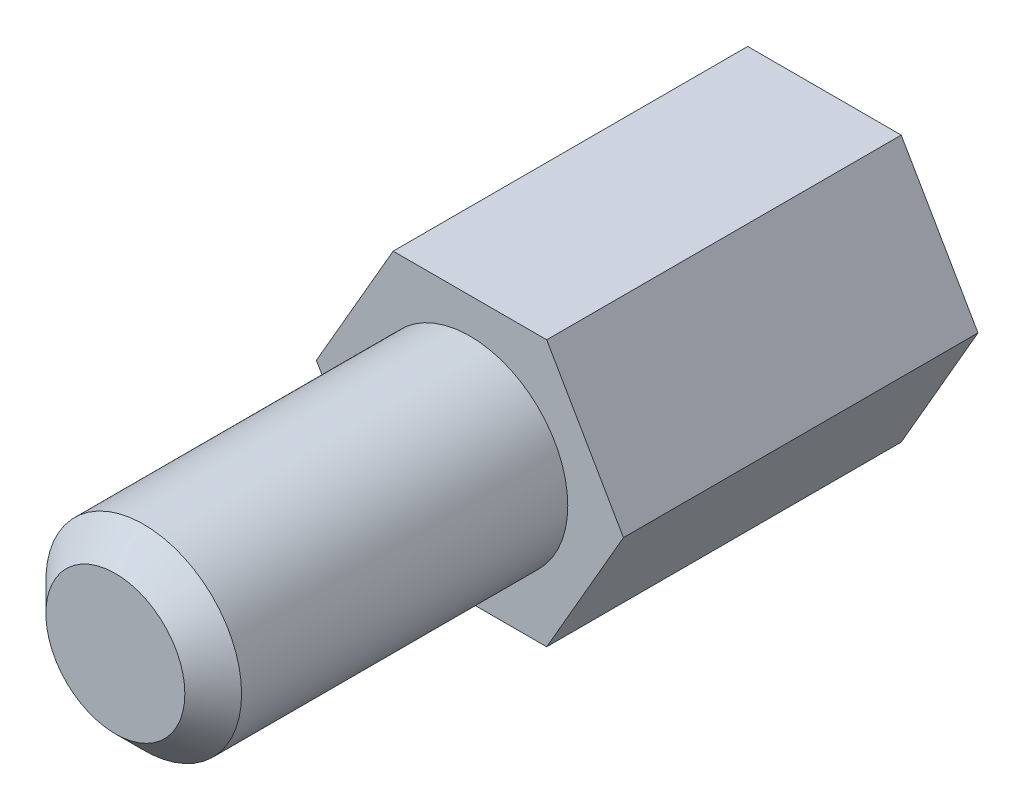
ISO-10303-21;
HEADER;
FILE_DESCRIPTION(('STEP AP214'),'2;1');
FILE_NAME('part.step','',(''),(''),'','','');
FILE_SCHEMA(('AUTOMOTIVE_DESIGN { 1 0 10303 214 1 1 1 1 }'));
ENDSEC;
DATA;
#1=APPLICATION_CONTEXT('core data for automotive mechanical design processes');
#2=APPLICATION_PROTOCOL_DEFINITION('international standard','automotive_design',2000,#1);
#3=PRODUCT_CONTEXT('',#1,'mechanical');
#4=PRODUCT('Part','Part','',(#3));
#5=PRODUCT_RELATED_PRODUCT_CATEGORY('part','',(#4));
#6=PRODUCT_DEFINITION_FORMATION('','',#4);
#7=PRODUCT_DEFINITION_CONTEXT('part definition',#1,'design');
#8=PRODUCT_DEFINITION('design','',#6,#7);
#9=PRODUCT_DEFINITION_SHAPE('','',#8);
#10=(LENGTH_UNIT() NAMED_UNIT(*) SI_UNIT(.MILLI.,.METRE.));
#11=(NAMED_UNIT(*) PLANE_ANGLE_UNIT() SI_UNIT($,.RADIAN.));
#12=(NAMED_UNIT(*) SI_UNIT($,.STERADIAN.) SOLID_ANGLE_UNIT());
#13=UNCERTAINTY_MEASURE_WITH_UNIT(LENGTH_MEASURE(1.E-05),#10,'distance_accuracy_value','');
#14=(GEOMETRIC_REPRESENTATION_CONTEXT(3) GLOBAL_UNCERTAINTY_ASSIGNED_CONTEXT((#13)) GLOBAL_UNIT_ASSIGNED_CONTEXT((#10,
#11,#12)) REPRESENTATION_CONTEXT('',''));
#15=CARTESIAN_POINT('',(0.,0.,0.));
#16=DIRECTION('',(0.,0.,1.));
#17=DIRECTION('',(1.,0.,0.));
#18=AXIS2_PLACEMENT_3D('',#15,#16,#17);
#19=CARTESIAN_POINT('',(0.,1.5482407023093E-13,6.34999999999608));
#20=DIRECTION('',(0.,0.,-1.00000000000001));
#21=DIRECTION('',(-1.00000000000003,0.,0.));
#22=AXIS2_PLACEMENT_3D('',#19,#20,#21);
#23=CYLINDRICAL_SURFACE('',#22,1.7526);
#24=CARTESIAN_POINT('',(0.,0.,5.84199999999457));
#25=DIRECTION('',(0.,0.,1.00000000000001));
#26=DIRECTION('',(1.00000000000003,0.,0.));
#27=AXIS2_PLACEMENT_3D('',#24,#25,#26);
#28=CIRCLE('',#27,1.7526);
#29=CARTESIAN_POINT('',(1.75260000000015,0.,5.84199999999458));
#30=VERTEX_POINT('',#29);
#31=EDGE_CURVE('E11',#30,#30,#28,.F.);
#32=ORIENTED_EDGE('',*,*,#31,.T.);
#33=EDGE_LOOP('',(#32));
#34=FACE_BOUND('',#33,.T.);
#35=CARTESIAN_POINT('',(0.,0.,-3.5527136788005E-12));
#36=DIRECTION('',(0.,0.,1.00000000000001));
#37=DIRECTION('',(1.00000000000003,0.,0.));
#38=AXIS2_PLACEMENT_3D('',#35,#36,#37);
#39=CIRCLE('',#38,1.7526);
#40=CARTESIAN_POINT('',(1.75260000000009,0.,-3.54328882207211E-12));
#41=VERTEX_POINT('',#40);
#42=EDGE_CURVE('E105',#41,#41,#39,.T.);
#43=ORIENTED_EDGE('',*,*,#42,.T.);
#44=EDGE_LOOP('',(#43));
#45=FACE_BOUND('',#44,.T.);
#46=ADVANCED_FACE('F34',(#34,#45),#23,.T.);
#47=CARTESIAN_POINT('',(0.,1.5482407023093E-13,6.34999999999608));
#48=DIRECTION('',(0.,0.,1.00000000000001));
#49=DIRECTION('',(1.00000000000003,0.,0.));
#50=AXIS2_PLACEMENT_3D('',#47,#48,#49);
#51=PLANE('',#50);
#52=CARTESIAN_POINT('',(0.,1.5482407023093E-13,6.34999999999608));
#53=DIRECTION('',(0.,0.,1.00000000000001));
#54=DIRECTION('',(1.00000000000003,0.,0.));
#55=AXIS2_PLACEMENT_3D('',#52,#53,#54);
#56=CIRCLE('',#55,1.24459999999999);
#57=CARTESIAN_POINT('',(1.2446,1.864669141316E-13,6.34999999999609));
#58=VERTEX_POINT('',#57);
#59=EDGE_CURVE('E41',#58,#58,#56,.T.);
#60=ORIENTED_EDGE('',*,*,#59,.T.);
#61=EDGE_LOOP('',(#60));
#62=FACE_BOUND('',#61,.T.);
#63=ADVANCED_FACE('F149',(#62),#51,.T.);
#64=CARTESIAN_POINT('',(1.38777878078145E-13,4.76250000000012,-8.88178419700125E-13));
#65=DIRECTION('',(0.,0.,1.00000000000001));
#66=DIRECTION('',(1.00000000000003,0.,0.));
#67=AXIS2_PLACEMENT_3D('',#64,#65,#66);
#68=PLANE('',#67);
#69=DIRECTION('',(0.499999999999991,-0.866025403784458,0.));
#70=VECTOR('',#69,1.);
#71=CARTESIAN_POINT('',(2.74963065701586,2.91867224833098E-13,1.33226762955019E-12));
#72=LINE('',#71,#70);
#73=CARTESIAN_POINT('',(1.37481532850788,2.38125000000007,4.44089209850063E-13));
#74=VERTEX_POINT('',#73);
#75=CARTESIAN_POINT('',(2.74963065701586,2.91867224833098E-13,1.33226762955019E-12));
#76=VERTEX_POINT('',#75);
#77=EDGE_CURVE('E92',#74,#76,#72,.T.);
#78=ORIENTED_EDGE('',*,*,#77,.F.);
#79=DIRECTION('',(1.00000000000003,0.,0.));
#80=VECTOR('',#79,1.);
#81=CARTESIAN_POINT('',(1.37481532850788,2.38125000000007,4.44089209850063E-13));
#82=LINE('',#81,#80);
#83=CARTESIAN_POINT('',(-1.37481532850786,2.38125000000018,2.88657986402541E-12));
#84=VERTEX_POINT('',#83);
#85=EDGE_CURVE('E123',#84,#74,#82,.T.);
#86=ORIENTED_EDGE('',*,*,#85,.F.);
#87=DIRECTION('',(0.500000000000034,0.866025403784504,0.));
#88=VECTOR('',#87,1.);
#89=CARTESIAN_POINT('',(-1.37481532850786,2.38125000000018,2.88657986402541E-12));
#90=LINE('',#89,#88);
#91=CARTESIAN_POINT('',(-2.74963065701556,2.39825520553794E-13,2.88657986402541E-12));
#92=VERTEX_POINT('',#91);
#93=EDGE_CURVE('E121',#92,#84,#90,.T.);
#94=ORIENTED_EDGE('',*,*,#93,.F.);
#95=DIRECTION('',(-0.499999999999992,0.866025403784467,0.));
#96=VECTOR('',#95,1.);
#97=CARTESIAN_POINT('',(-2.74963065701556,2.39825520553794E-13,2.88657986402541E-12));
#98=LINE('',#97,#96);
#99=CARTESIAN_POINT('',(-1.37481532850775,-2.38124999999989,3.5527136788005E-12));
#100=VERTEX_POINT('',#99);
#101=EDGE_CURVE('E119',#100,#92,#98,.T.);
#102=ORIENTED_EDGE('',*,*,#101,.F.);
#103=DIRECTION('',(-1.00000000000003,0.,0.));
#104=VECTOR('',#103,1.);
#105=CARTESIAN_POINT('',(-1.37481532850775,-2.38124999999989,3.5527136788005E-12));
#106=LINE('',#105,#104);
#107=CARTESIAN_POINT('',(1.374815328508,-2.38125000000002,-4.88498130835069E-12));
#108=VERTEX_POINT('',#107);
#109=EDGE_CURVE('E94',#108,#100,#106,.T.);
#110=ORIENTED_EDGE('',*,*,#109,.F.);
#111=DIRECTION('',(-0.500000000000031,-0.86602540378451,0.));
#112=VECTOR('',#111,1.);
#113=CARTESIAN_POINT('',(1.374815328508,-2.38125000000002,-4.88498130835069E-12));
#114=LINE('',#113,#112);
#115=EDGE_CURVE('E86',#76,#108,#114,.T.);
#116=ORIENTED_EDGE('',*,*,#115,.F.);
#117=EDGE_LOOP('',(#78,#86,#94,#102,#110,#116));
#118=FACE_BOUND('',#117,.T.);
#119=ORIENTED_EDGE('',*,*,#42,.F.);
#120=EDGE_LOOP('',(#119));
#121=FACE_BOUND('',#120,.T.);
#122=ADVANCED_FACE('F88',(#118,#121),#68,.T.);
#123=CARTESIAN_POINT('',(2.74963065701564,0.,-6.3499999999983));
#124=DIRECTION('',(-0.866025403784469,-0.500000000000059,0.));
#125=DIRECTION('',(0.499999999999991,-0.866025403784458,0.));
#126=AXIS2_PLACEMENT_3D('',#123,#124,#125);
#127=PLANE('',#126);
#128=ORIENTED_EDGE('',*,*,#77,.T.);
#129=DIRECTION('',(0.,0.,1.00000000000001));
#130=VECTOR('',#129,1.);
#131=CARTESIAN_POINT('',(2.74963065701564,0.,-6.3499999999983));
#132=LINE('',#131,#130);
#133=CARTESIAN_POINT('',(2.74963065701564,0.,-6.3499999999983));
#134=VERTEX_POINT('',#133);
#135=EDGE_CURVE('E100',#134,#76,#132,.T.);
#136=ORIENTED_EDGE('',*,*,#135,.F.);
#137=DIRECTION('',(0.499999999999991,-0.866025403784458,0.));
#138=VECTOR('',#137,1.);
#139=CARTESIAN_POINT('',(2.74963065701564,0.,-6.3499999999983));
#140=LINE('',#139,#138);
#141=CARTESIAN_POINT('',(1.37481532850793,2.38125000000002,-6.35000000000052));
#142=VERTEX_POINT('',#141);
#143=EDGE_CURVE('E125',#142,#134,#140,.T.);
#144=ORIENTED_EDGE('',*,*,#143,.F.);
#145=DIRECTION('',(0.,0.,1.00000000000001));
#146=VECTOR('',#145,1.);
#147=CARTESIAN_POINT('',(1.37481532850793,2.38125000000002,-6.35000000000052));
#148=LINE('',#147,#146);
#149=EDGE_CURVE('E110',#142,#74,#148,.T.);
#150=ORIENTED_EDGE('',*,*,#149,.T.);
#151=EDGE_LOOP('',(#128,#136,#144,#150));
#152=FACE_BOUND('',#151,.T.);
#153=ADVANCED_FACE('F109',(#152),#127,.F.);
#154=CARTESIAN_POINT('',(1.37481532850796,-2.38124999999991,-6.35000000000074));
#155=DIRECTION('',(-0.866025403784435,0.500000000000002,0.));
#156=DIRECTION('',(-0.500000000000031,-0.86602540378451,0.));
#157=AXIS2_PLACEMENT_3D('',#154,#155,#156);
#158=PLANE('',#157);
#159=ORIENTED_EDGE('',*,*,#115,.T.);
#160=DIRECTION('',(0.,0.,1.00000000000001));
#161=VECTOR('',#160,1.);
#162=CARTESIAN_POINT('',(1.37481532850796,-2.38124999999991,-6.35000000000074));
#163=LINE('',#162,#161);
#164=CARTESIAN_POINT('',(1.37481532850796,-2.38124999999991,-6.35000000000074));
#165=VERTEX_POINT('',#164);
#166=EDGE_CURVE('E106',#165,#108,#163,.T.);
#167=ORIENTED_EDGE('',*,*,#166,.F.);
#168=DIRECTION('',(-0.500000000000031,-0.86602540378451,0.));
#169=VECTOR('',#168,1.);
#170=CARTESIAN_POINT('',(1.37481532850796,-2.38124999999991,-6.35000000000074));
#171=LINE('',#170,#169);
#172=EDGE_CURVE('E102',#134,#165,#171,.T.);
#173=ORIENTED_EDGE('',*,*,#172,.F.);
#174=ORIENTED_EDGE('',*,*,#135,.T.);
#175=EDGE_LOOP('',(#159,#167,#173,#174));
#176=FACE_BOUND('',#175,.T.);
#177=ADVANCED_FACE('F101',(#176),#158,.F.);
#178=CARTESIAN_POINT('',(-1.37481532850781,-2.3812500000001,-6.3500000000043));
#179=DIRECTION('',(0.,1.00000000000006,0.));
#180=DIRECTION('',(0.,0.,1.00000000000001));
#181=AXIS2_PLACEMENT_3D('',#178,#179,#180);
#182=PLANE('',#181);
#183=ORIENTED_EDGE('',*,*,#109,.T.);
#184=DIRECTION('',(0.,0.,1.00000000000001));
#185=VECTOR('',#184,1.);
#186=CARTESIAN_POINT('',(-1.37481532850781,-2.3812500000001,-6.3500000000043));
#187=LINE('',#186,#185);
#188=CARTESIAN_POINT('',(-1.37481532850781,-2.3812500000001,-6.3500000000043));
#189=VERTEX_POINT('',#188);
#190=EDGE_CURVE('E141',#189,#100,#187,.T.);
#191=ORIENTED_EDGE('',*,*,#190,.F.);
#192=DIRECTION('',(-1.00000000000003,0.,0.));
#193=VECTOR('',#192,1.);
#194=CARTESIAN_POINT('',(-1.37481532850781,-2.3812500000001,-6.3500000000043));
#195=LINE('',#194,#193);
#196=EDGE_CURVE('E128',#165,#189,#195,.T.);
#197=ORIENTED_EDGE('',*,*,#196,.F.);
#198=ORIENTED_EDGE('',*,*,#166,.T.);
#199=EDGE_LOOP('',(#183,#191,#197,#198));
#200=FACE_BOUND('',#199,.T.);
#201=ADVANCED_FACE('F192',(#200),#182,.F.);
#202=CARTESIAN_POINT('',(-2.74963065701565,0.,-6.35000000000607));
#203=DIRECTION('',(0.86602540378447,0.500000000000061,0.));
#204=DIRECTION('',(-0.499999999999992,0.866025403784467,0.));
#205=AXIS2_PLACEMENT_3D('',#202,#203,#204);
#206=PLANE('',#205);
#207=ORIENTED_EDGE('',*,*,#101,.T.);
#208=DIRECTION('',(0.,0.,1.00000000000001));
#209=VECTOR('',#208,1.);
#210=CARTESIAN_POINT('',(-2.74963065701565,0.,-6.35000000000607));
#211=LINE('',#210,#209);
#212=CARTESIAN_POINT('',(-2.74963065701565,0.,-6.35000000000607));
#213=VERTEX_POINT('',#212);
#214=EDGE_CURVE('E138',#213,#92,#211,.T.);
#215=ORIENTED_EDGE('',*,*,#214,.F.);
#216=DIRECTION('',(-0.499999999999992,0.866025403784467,0.));
#217=VECTOR('',#216,1.);
#218=CARTESIAN_POINT('',(-2.74963065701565,0.,-6.35000000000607));
#219=LINE('',#218,#217);
#220=EDGE_CURVE('E130',#189,#213,#219,.T.);
#221=ORIENTED_EDGE('',*,*,#220,.F.);
#222=ORIENTED_EDGE('',*,*,#190,.T.);
#223=EDGE_LOOP('',(#207,#215,#221,#222));
#224=FACE_BOUND('',#223,.T.);
#225=ADVANCED_FACE('F188',(#224),#206,.F.);
#226=CARTESIAN_POINT('',(-1.37481532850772,2.38125000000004,-6.34999999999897));
#227=DIRECTION('',(0.866025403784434,-0.500000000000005,0.));
#228=DIRECTION('',(0.500000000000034,0.866025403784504,0.));
#229=AXIS2_PLACEMENT_3D('',#226,#227,#228);
#230=PLANE('',#229);
#231=ORIENTED_EDGE('',*,*,#93,.T.);
#232=DIRECTION('',(0.,0.,1.00000000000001));
#233=VECTOR('',#232,1.);
#234=CARTESIAN_POINT('',(-1.37481532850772,2.38125000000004,-6.34999999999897));
#235=LINE('',#234,#233);
#236=CARTESIAN_POINT('',(-1.37481532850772,2.38125000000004,-6.34999999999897));
#237=VERTEX_POINT('',#236);
#238=EDGE_CURVE('E135',#237,#84,#235,.T.);
#239=ORIENTED_EDGE('',*,*,#238,.F.);
#240=DIRECTION('',(0.500000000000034,0.866025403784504,0.));
#241=VECTOR('',#240,1.);
#242=CARTESIAN_POINT('',(-1.37481532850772,2.38125000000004,-6.34999999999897));
#243=LINE('',#242,#241);
#244=EDGE_CURVE('E53',#213,#237,#243,.T.);
#245=ORIENTED_EDGE('',*,*,#244,.F.);
#246=ORIENTED_EDGE('',*,*,#214,.T.);
#247=EDGE_LOOP('',(#231,#239,#245,#246));
#248=FACE_BOUND('',#247,.T.);
#249=ADVANCED_FACE('F184',(#248),#230,.F.);
#250=CARTESIAN_POINT('',(1.37481532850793,2.38125000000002,-6.35000000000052));
#251=DIRECTION('',(0.,-1.00000000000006,0.));
#252=DIRECTION('',(0.,0.,-1.00000000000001));
#253=AXIS2_PLACEMENT_3D('',#250,#251,#252);
#254=PLANE('',#253);
#255=ORIENTED_EDGE('',*,*,#85,.T.);
#256=ORIENTED_EDGE('',*,*,#149,.F.);
#257=DIRECTION('',(1.00000000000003,0.,0.));
#258=VECTOR('',#257,1.);
#259=CARTESIAN_POINT('',(1.37481532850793,2.38125000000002,-6.35000000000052));
#260=LINE('',#259,#258);
#261=EDGE_CURVE('E48',#237,#142,#260,.T.);
#262=ORIENTED_EDGE('',*,*,#261,.F.);
#263=ORIENTED_EDGE('',*,*,#238,.T.);
#264=EDGE_LOOP('',(#255,#256,#262,#263));
#265=FACE_BOUND('',#264,.T.);
#266=ADVANCED_FACE('F164',(#265),#254,.F.);
#267=CARTESIAN_POINT('',(0.,4.76250000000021,-6.35000000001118));
#268=DIRECTION('',(0.,0.,1.00000000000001));
#269=DIRECTION('',(1.00000000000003,0.,0.));
#270=AXIS2_PLACEMENT_3D('',#267,#268,#269);
#271=PLANE('',#270);
#272=CARTESIAN_POINT('',(0.,1.30537941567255E-13,-6.35000000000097));
#273=DIRECTION('',(0.,0.,-1.00000000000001));
#274=DIRECTION('',(-1.00000000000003,0.,0.));
#275=AXIS2_PLACEMENT_3D('',#272,#273,#274);
#276=CIRCLE('',#275,1.3208);
#277=CARTESIAN_POINT('',(-1.32079999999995,0.,-6.35000000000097));
#278=VERTEX_POINT('',#277);
#279=EDGE_CURVE('E114',#278,#278,#276,.T.);
#280=ORIENTED_EDGE('',*,*,#279,.F.);
#281=EDGE_LOOP('',(#280));
#282=FACE_BOUND('',#281,.T.);
#283=ORIENTED_EDGE('',*,*,#143,.T.);
#284=ORIENTED_EDGE('',*,*,#172,.T.);
#285=ORIENTED_EDGE('',*,*,#196,.T.);
#286=ORIENTED_EDGE('',*,*,#220,.T.);
#287=ORIENTED_EDGE('',*,*,#244,.T.);
#288=ORIENTED_EDGE('',*,*,#261,.T.);
#289=EDGE_LOOP('',(#283,#284,#285,#286,#287,#288));
#290=FACE_BOUND('',#289,.T.);
#291=ADVANCED_FACE('F154',(#282,#290),#271,.F.);
#292=CARTESIAN_POINT('',(0.,1.5482407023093E-13,6.34999999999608));
#293=DIRECTION('',(0.,0.,-1.00000000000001));
#294=DIRECTION('',(-1.00000000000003,0.,0.));
#295=AXIS2_PLACEMENT_3D('',#292,#293,#294);
#296=CONICAL_SURFACE('',#295,1.24459999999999,0.785398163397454);
#297=ORIENTED_EDGE('',*,*,#31,.F.);
#298=EDGE_LOOP('',(#297));
#299=FACE_BOUND('',#298,.T.);
#300=ORIENTED_EDGE('',*,*,#59,.F.);
#301=EDGE_LOOP('',(#300));
#302=FACE_BOUND('',#301,.T.);
#303=ADVANCED_FACE('F151',(#299,#302),#296,.T.);
#304=CARTESIAN_POINT('',(-1.2490009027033E-13,9.64939933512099E-13,-2.38759999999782));
#305=DIRECTION('',(0.,0.,-1.00000000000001));
#306=DIRECTION('',(-1.00000000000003,0.,0.));
#307=AXIS2_PLACEMENT_3D('',#304,#305,#306);
#308=CYLINDRICAL_SURFACE('',#307,1.3208);
#309=CARTESIAN_POINT('',(-1.2490009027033E-13,9.64939933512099E-13,-2.38759999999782));
#310=DIRECTION('',(0.,0.,-1.00000000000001));
#311=DIRECTION('',(-1.00000000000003,0.,0.));
#312=AXIS2_PLACEMENT_3D('',#309,#310,#311);
#313=CIRCLE('',#312,1.3208);
#314=CARTESIAN_POINT('',(-1.32080000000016,9.31359772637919E-13,-2.38759999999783));
#315=VERTEX_POINT('',#314);
#316=EDGE_CURVE('E111',#315,#315,#313,.T.);
#317=ORIENTED_EDGE('',*,*,#316,.F.);
#318=EDGE_LOOP('',(#317));
#319=FACE_BOUND('',#318,.T.);
#320=ORIENTED_EDGE('',*,*,#279,.T.);
#321=EDGE_LOOP('',(#320));
#322=FACE_BOUND('',#321,.T.);
#323=ADVANCED_FACE('F153',(#319,#322),#308,.F.);
#324=CARTESIAN_POINT('',(-1.2490009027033E-13,9.64939933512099E-13,-2.38759999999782));
#325=DIRECTION('',(0.,0.,-1.00000000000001));
#326=DIRECTION('',(-1.00000000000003,0.,0.));
#327=AXIS2_PLACEMENT_3D('',#324,#325,#326);
#328=PLANE('',#327);
#329=ORIENTED_EDGE('',*,*,#316,.T.);
#330=EDGE_LOOP('',(#329));
#331=FACE_BOUND('',#330,.T.);
#332=ADVANCED_FACE('F161',(#331),#328,.T.);
#333=CLOSED_SHELL('',(#46,#63,#122,#153,#177,#201,#225,#249,#266,#291,#303,#323,#332));
#334=MANIFOLD_SOLID_BREP('B2',#333);
#335=ADVANCED_BREP_SHAPE_REPRESENTATION('',(#18,#334),#14);
#336=SHAPE_DEFINITION_REPRESENTATION(#9,#335);
ENDSEC;
END-ISO-10303-21;
